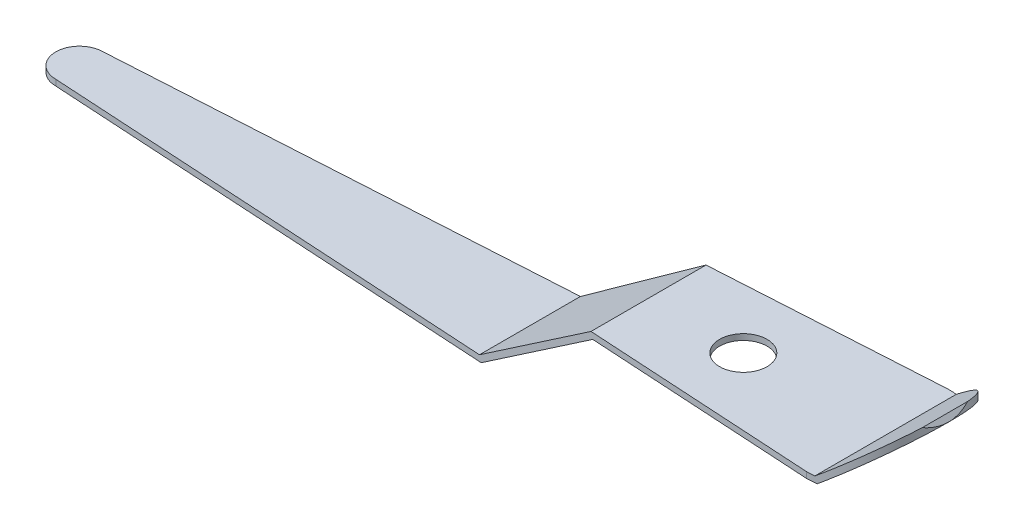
ISO-10303-21;
HEADER;
FILE_DESCRIPTION(('STEP AP214'),'2;1');
FILE_NAME('part.step','',(''),(''),'','','');
FILE_SCHEMA(('AUTOMOTIVE_DESIGN { 1 0 10303 214 1 1 1 1 }'));
ENDSEC;
DATA;
#1=APPLICATION_CONTEXT('core data for automotive mechanical design processes');
#2=APPLICATION_PROTOCOL_DEFINITION('international standard','automotive_design',2000,#1);
#3=PRODUCT_CONTEXT('',#1,'mechanical');
#4=PRODUCT('Part','Part','',(#3));
#5=PRODUCT_RELATED_PRODUCT_CATEGORY('part','',(#4));
#6=PRODUCT_DEFINITION_FORMATION('','',#4);
#7=PRODUCT_DEFINITION_CONTEXT('part definition',#1,'design');
#8=PRODUCT_DEFINITION('design','',#6,#7);
#9=PRODUCT_DEFINITION_SHAPE('','',#8);
#10=(LENGTH_UNIT() NAMED_UNIT(*) SI_UNIT(.MILLI.,.METRE.));
#11=(NAMED_UNIT(*) PLANE_ANGLE_UNIT() SI_UNIT($,.RADIAN.));
#12=(NAMED_UNIT(*) SI_UNIT($,.STERADIAN.) SOLID_ANGLE_UNIT());
#13=UNCERTAINTY_MEASURE_WITH_UNIT(LENGTH_MEASURE(1.E-05),#10,'distance_accuracy_value','');
#14=(GEOMETRIC_REPRESENTATION_CONTEXT(3) GLOBAL_UNCERTAINTY_ASSIGNED_CONTEXT((#13)) GLOBAL_UNIT_ASSIGNED_CONTEXT((#10,
#11,#12)) REPRESENTATION_CONTEXT('',''));
#15=CARTESIAN_POINT('',(0.,0.,0.));
#16=DIRECTION('',(0.,0.,1.));
#17=DIRECTION('',(1.,0.,0.));
#18=AXIS2_PLACEMENT_3D('',#15,#16,#17);
#19=CARTESIAN_POINT('',(0.,0.,12.));
#20=DIRECTION('',(0.,-1.,0.));
#21=DIRECTION('',(0.,0.,-1.));
#22=AXIS2_PLACEMENT_3D('',#19,#20,#21);
#23=PLANE('',#22);
#24=DIRECTION('',(0.998239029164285,0.,-0.0593198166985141));
#25=VECTOR('',#24,1.);
#26=CARTESIAN_POINT('',(-0.466685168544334,0.,4.14658143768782));
#27=LINE('',#26,#25);
#28=CARTESIAN_POINT('',(2.,0.,4.));
#29=VERTEX_POINT('',#28);
#30=CARTESIAN_POINT('',(40.,0.,1.74187046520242));
#31=VERTEX_POINT('',#30);
#32=EDGE_CURVE('E136',#29,#31,#27,.T.);
#33=ORIENTED_EDGE('',*,*,#32,.F.);
#34=CARTESIAN_POINT('',(2.,0.,6.));
#35=DIRECTION('',(0.,-1.,0.));
#36=DIRECTION('',(0.,0.,-1.));
#37=AXIS2_PLACEMENT_3D('',#34,#35,#36);
#38=CIRCLE('',#37,2.);
#39=CARTESIAN_POINT('',(2.,0.,8.));
#40=VERTEX_POINT('',#39);
#41=EDGE_CURVE('E12',#40,#29,#38,.T.);
#42=ORIENTED_EDGE('',*,*,#41,.F.);
#43=DIRECTION('',(-0.998239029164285,0.,-0.0593198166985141));
#44=VECTOR('',#43,1.);
#45=CARTESIAN_POINT('',(0.243899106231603,0.,7.89564465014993));
#46=LINE('',#45,#44);
#47=CARTESIAN_POINT('',(40.,0.,10.2581295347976));
#48=VERTEX_POINT('',#47);
#49=EDGE_CURVE('E154',#48,#40,#46,.T.);
#50=ORIENTED_EDGE('',*,*,#49,.F.);
#51=DIRECTION('',(0.,0.,-1.));
#52=VECTOR('',#51,1.);
#53=CARTESIAN_POINT('',(40.,0.,12.));
#54=LINE('',#53,#52);
#55=EDGE_CURVE('E164',#48,#31,#54,.T.);
#56=ORIENTED_EDGE('',*,*,#55,.T.);
#57=EDGE_LOOP('',(#33,#42,#50,#56));
#58=FACE_BOUND('',#57,.T.);
#59=ADVANCED_FACE('F28',(#58),#23,.F.);
#60=CARTESIAN_POINT('',(40.,0.,12.));
#61=DIRECTION('',(0.573462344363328,-0.81923192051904,0.));
#62=DIRECTION('',(0.819231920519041,0.573462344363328,0.));
#63=AXIS2_PLACEMENT_3D('',#60,#61,#62);
#64=PLANE('',#63);
#65=DIRECTION('',(0.818262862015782,0.572784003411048,-0.0486248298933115));
#66=VECTOR('',#65,1.);
#67=CARTESIAN_POINT('',(39.5918506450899,-0.28570454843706,1.76612452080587));
#68=LINE('',#67,#66);
#69=CARTESIAN_POINT('',(50.,7.,1.147625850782));
#70=VERTEX_POINT('',#69);
#71=EDGE_CURVE('E139',#31,#70,#68,.T.);
#72=ORIENTED_EDGE('',*,*,#71,.F.);
#73=ORIENTED_EDGE('',*,*,#55,.F.);
#74=DIRECTION('',(-0.818262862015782,-0.572784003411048,-0.0486248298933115));
#75=VECTOR('',#74,1.);
#76=CARTESIAN_POINT('',(40.0693053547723,0.048513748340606,10.26224796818));
#77=LINE('',#76,#75);
#78=CARTESIAN_POINT('',(50.,7.,10.852374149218));
#79=VERTEX_POINT('',#78);
#80=EDGE_CURVE('E156',#79,#48,#77,.T.);
#81=ORIENTED_EDGE('',*,*,#80,.F.);
#82=DIRECTION('',(0.,0.,-1.));
#83=VECTOR('',#82,1.);
#84=CARTESIAN_POINT('',(50.,7.,12.));
#85=LINE('',#84,#83);
#86=EDGE_CURVE('E167',#79,#70,#85,.T.);
#87=ORIENTED_EDGE('',*,*,#86,.T.);
#88=EDGE_LOOP('',(#72,#73,#81,#87));
#89=FACE_BOUND('',#88,.T.);
#90=ADVANCED_FACE('F238',(#89),#64,.F.);
#91=CARTESIAN_POINT('',(50.,7.,12.));
#92=DIRECTION('',(0.,-1.,0.));
#93=DIRECTION('',(0.,0.,-1.));
#94=AXIS2_PLACEMENT_3D('',#91,#92,#93);
#95=PLANE('',#94);
#96=CARTESIAN_POINT('',(58.,7.,6.));
#97=DIRECTION('',(0.,1.,0.));
#98=DIRECTION('',(0.,0.,1.));
#99=AXIS2_PLACEMENT_3D('',#96,#97,#98);
#100=CIRCLE('',#99,2.);
#101=CARTESIAN_POINT('',(58.,7.,8.));
#102=VERTEX_POINT('',#101);
#103=EDGE_CURVE('E206',#102,#102,#100,.T.);
#104=ORIENTED_EDGE('',*,*,#103,.F.);
#105=EDGE_LOOP('',(#104));
#106=FACE_BOUND('',#105,.T.);
#107=DIRECTION('',(0.998239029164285,0.,-0.0593198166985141));
#108=VECTOR('',#107,1.);
#109=CARTESIAN_POINT('',(49.3573727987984,7.,1.18581362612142));
#110=LINE('',#109,#108);
#111=CARTESIAN_POINT('',(69.3123475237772,7.,0.));
#112=VERTEX_POINT('',#111);
#113=EDGE_CURVE('E146',#70,#112,#110,.T.);
#114=ORIENTED_EDGE('',*,*,#113,.F.);
#115=ORIENTED_EDGE('',*,*,#86,.F.);
#116=DIRECTION('',(-0.998239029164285,0.,-0.0593198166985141));
#117=VECTOR('',#116,1.);
#118=CARTESIAN_POINT('',(50.0679570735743,7.,10.8564124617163));
#119=LINE('',#118,#117);
#120=CARTESIAN_POINT('',(69.3123475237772,7.,12.));
#121=VERTEX_POINT('',#120);
#122=EDGE_CURVE('E122',#121,#79,#119,.T.);
#123=ORIENTED_EDGE('',*,*,#122,.F.);
#124=CARTESIAN_POINT('',(69.3123475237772,7.,6.));
#125=DIRECTION('',(0.,-1.,0.));
#126=DIRECTION('',(0.,0.,-1.));
#127=AXIS2_PLACEMENT_3D('',#124,#125,#126);
#128=CIRCLE('',#127,6.);
#129=CARTESIAN_POINT('',(70.,7.,11.9604642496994));
#130=VERTEX_POINT('',#129);
#131=EDGE_CURVE('E126',#130,#121,#128,.T.);
#132=ORIENTED_EDGE('',*,*,#131,.F.);
#133=DIRECTION('',(0.,0.,-1.));
#134=VECTOR('',#133,1.);
#135=CARTESIAN_POINT('',(70.,7.,12.));
#136=LINE('',#135,#134);
#137=CARTESIAN_POINT('',(70.,7.,0.0395357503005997));
#138=VERTEX_POINT('',#137);
#139=EDGE_CURVE('E170',#130,#138,#136,.T.);
#140=ORIENTED_EDGE('',*,*,#139,.T.);
#141=EDGE_CURVE('E202',#112,#138,#128,.T.);
#142=ORIENTED_EDGE('',*,*,#141,.F.);
#143=EDGE_LOOP('',(#114,#115,#123,#132,#140,#142));
#144=FACE_BOUND('',#143,.T.);
#145=ADVANCED_FACE('F244',(#106,#144),#95,.F.);
#146=CARTESIAN_POINT('',(70.,7.,12.));
#147=DIRECTION('',(0.624695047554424,-0.780868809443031,0.));
#148=DIRECTION('',(0.780868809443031,0.624695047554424,0.));
#149=AXIS2_PLACEMENT_3D('',#146,#147,#148);
#150=PLANE('',#149);
#151=CARTESIAN_POINT('',(69.3123475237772,6.44987801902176,6.));
#152=DIRECTION('',(0.624695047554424,-0.780868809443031,0.));
#153=DIRECTION('',(0.780868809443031,0.624695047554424,0.));
#154=AXIS2_PLACEMENT_3D('',#151,#152,#153);
#155=ELLIPSE('',#154,7.68374908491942,6.);
#156=CARTESIAN_POINT('',(75.,11.,7.91065677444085));
#157=VERTEX_POINT('',#156);
#158=EDGE_CURVE('E200',#157,#130,#155,.T.);
#159=ORIENTED_EDGE('',*,*,#158,.F.);
#160=DIRECTION('',(0.,0.,-1.));
#161=VECTOR('',#160,1.);
#162=CARTESIAN_POINT('',(75.,11.,12.));
#163=LINE('',#162,#161);
#164=CARTESIAN_POINT('',(75.,11.,4.08934322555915));
#165=VERTEX_POINT('',#164);
#166=EDGE_CURVE('E173',#157,#165,#163,.T.);
#167=ORIENTED_EDGE('',*,*,#166,.T.);
#168=EDGE_CURVE('E210',#138,#165,#155,.T.);
#169=ORIENTED_EDGE('',*,*,#168,.F.);
#170=ORIENTED_EDGE('',*,*,#139,.F.);
#171=EDGE_LOOP('',(#159,#167,#169,#170));
#172=FACE_BOUND('',#171,.T.);
#173=ADVANCED_FACE('F251',(#172),#150,.F.);
#174=CARTESIAN_POINT('',(75.,11.,12.));
#175=DIRECTION('',(-0.780868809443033,-0.624695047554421,0.));
#176=DIRECTION('',(0.624695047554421,-0.780868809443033,0.));
#177=AXIS2_PLACEMENT_3D('',#174,#175,#176);
#178=PLANE('',#177);
#179=CARTESIAN_POINT('',(69.3123475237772,18.1095655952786,6.));
#180=DIRECTION('',(-0.780868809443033,-0.624695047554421,0.));
#181=DIRECTION('',(-0.624695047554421,0.780868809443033,0.));
#182=AXIS2_PLACEMENT_3D('',#179,#180,#181);
#183=ELLIPSE('',#182,9.60468635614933,6.);
#184=CARTESIAN_POINT('',(75.3123475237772,10.6095655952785,6.));
#185=VERTEX_POINT('',#184);
#186=EDGE_CURVE('E211',#165,#185,#183,.T.);
#187=ORIENTED_EDGE('',*,*,#186,.F.);
#188=ORIENTED_EDGE('',*,*,#166,.F.);
#189=EDGE_CURVE('E209',#185,#157,#183,.T.);
#190=ORIENTED_EDGE('',*,*,#189,.F.);
#191=EDGE_LOOP('',(#187,#188,#190));
#192=FACE_BOUND('',#191,.T.);
#193=ADVANCED_FACE('F254',(#192),#178,.F.);
#194=CARTESIAN_POINT('',(2.,-12.,6.));
#195=DIRECTION('',(0.,1.,0.));
#196=DIRECTION('',(0.,0.,1.));
#197=AXIS2_PLACEMENT_3D('',#194,#195,#196);
#198=CYLINDRICAL_SURFACE('',#197,2.);
#199=CARTESIAN_POINT('',(2.,-0.5,6.));
#200=DIRECTION('',(0.,1.,0.));
#201=DIRECTION('',(0.,0.,1.));
#202=AXIS2_PLACEMENT_3D('',#199,#200,#201);
#203=CIRCLE('',#202,2.);
#204=CARTESIAN_POINT('',(2.,-0.5,4.));
#205=VERTEX_POINT('',#204);
#206=CARTESIAN_POINT('',(2.,-0.5,8.));
#207=VERTEX_POINT('',#206);
#208=EDGE_CURVE('E162',#205,#207,#203,.T.);
#209=ORIENTED_EDGE('',*,*,#208,.T.);
#210=DIRECTION('',(0.,1.,0.));
#211=VECTOR('',#210,1.);
#212=CARTESIAN_POINT('',(2.,-12.,8.));
#213=LINE('',#212,#211);
#214=EDGE_CURVE('E128',#207,#40,#213,.T.);
#215=ORIENTED_EDGE('',*,*,#214,.T.);
#216=ORIENTED_EDGE('',*,*,#41,.T.);
#217=DIRECTION('',(0.,1.,0.));
#218=VECTOR('',#217,1.);
#219=CARTESIAN_POINT('',(2.,-12.,4.));
#220=LINE('',#219,#218);
#221=EDGE_CURVE('E192',#205,#29,#220,.T.);
#222=ORIENTED_EDGE('',*,*,#221,.F.);
#223=EDGE_LOOP('',(#209,#215,#216,#222));
#224=FACE_BOUND('',#223,.T.);
#225=ADVANCED_FACE('F195',(#224),#198,.T.);
#226=CARTESIAN_POINT('',(69.3123475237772,-12.,12.));
#227=DIRECTION('',(-0.0593198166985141,0.,0.998239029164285));
#228=DIRECTION('',(0.998239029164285,0.,0.0593198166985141));
#229=AXIS2_PLACEMENT_3D('',#226,#227,#228);
#230=PLANE('',#229);
#231=DIRECTION('',(0.998239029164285,0.,0.0593198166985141));
#232=VECTOR('',#231,1.);
#233=CARTESIAN_POINT('',(0.243899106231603,-0.5,7.89564465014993));
#234=LINE('',#233,#232);
#235=CARTESIAN_POINT('',(40.1576111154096,-0.5,10.2674954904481));
#236=VERTEX_POINT('',#235);
#237=EDGE_CURVE('E160',#207,#236,#234,.T.);
#238=ORIENTED_EDGE('',*,*,#237,.T.);
#239=DIRECTION('',(0.818262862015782,0.572784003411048,0.0486248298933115));
#240=VECTOR('',#239,1.);
#241=CARTESIAN_POINT('',(40.2265438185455,-0.451747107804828,10.2715917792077));
#242=LINE('',#241,#240);
#243=CARTESIAN_POINT('',(50.1576111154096,6.5,10.8617401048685));
#244=VERTEX_POINT('',#243);
#245=EDGE_CURVE('E118',#236,#244,#242,.T.);
#246=ORIENTED_EDGE('',*,*,#245,.T.);
#247=DIRECTION('',(0.998239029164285,0.,0.0593198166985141));
#248=VECTOR('',#247,1.);
#249=CARTESIAN_POINT('',(50.2250135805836,6.5,10.8657454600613));
#250=LINE('',#249,#248);
#251=CARTESIAN_POINT('',(69.3123475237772,6.5,12.));
#252=VERTEX_POINT('',#251);
#253=EDGE_CURVE('E113',#244,#252,#250,.T.);
#254=ORIENTED_EDGE('',*,*,#253,.T.);
#255=DIRECTION('',(0.,1.,0.));
#256=VECTOR('',#255,1.);
#257=CARTESIAN_POINT('',(69.3123475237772,-12.,12.));
#258=LINE('',#257,#256);
#259=EDGE_CURVE('E115',#252,#121,#258,.T.);
#260=ORIENTED_EDGE('',*,*,#259,.T.);
#261=ORIENTED_EDGE('',*,*,#122,.T.);
#262=ORIENTED_EDGE('',*,*,#80,.T.);
#263=ORIENTED_EDGE('',*,*,#49,.T.);
#264=ORIENTED_EDGE('',*,*,#214,.F.);
#265=EDGE_LOOP('',(#238,#246,#254,#260,#261,#262,#263,#264));
#266=FACE_BOUND('',#265,.T.);
#267=ADVANCED_FACE('F114',(#266),#230,.T.);
#268=CARTESIAN_POINT('',(2.,-12.,4.));
#269=DIRECTION('',(-0.0593198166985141,0.,-0.998239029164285));
#270=DIRECTION('',(-0.998239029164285,0.,0.0593198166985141));
#271=AXIS2_PLACEMENT_3D('',#268,#269,#270);
#272=PLANE('',#271);
#273=DIRECTION('',(-0.998239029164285,0.,0.0593198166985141));
#274=VECTOR('',#273,1.);
#275=CARTESIAN_POINT('',(-0.466685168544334,-0.5,4.14658143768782));
#276=LINE('',#275,#274);
#277=CARTESIAN_POINT('',(40.1576111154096,-0.500000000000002,1.73250450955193));
#278=VERTEX_POINT('',#277);
#279=EDGE_CURVE('E152',#278,#205,#276,.T.);
#280=ORIENTED_EDGE('',*,*,#279,.T.);
#281=ORIENTED_EDGE('',*,*,#221,.T.);
#282=ORIENTED_EDGE('',*,*,#32,.T.);
#283=ORIENTED_EDGE('',*,*,#71,.T.);
#284=ORIENTED_EDGE('',*,*,#113,.T.);
#285=DIRECTION('',(0.,1.,0.));
#286=VECTOR('',#285,1.);
#287=CARTESIAN_POINT('',(69.3123475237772,-12.,0.));
#288=LINE('',#287,#286);
#289=CARTESIAN_POINT('',(69.3123475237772,6.5,0.));
#290=VERTEX_POINT('',#289);
#291=EDGE_CURVE('E127',#290,#112,#288,.T.);
#292=ORIENTED_EDGE('',*,*,#291,.F.);
#293=DIRECTION('',(-0.998239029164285,0.,0.0593198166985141));
#294=VECTOR('',#293,1.);
#295=CARTESIAN_POINT('',(49.5144293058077,6.5,1.17648062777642));
#296=LINE('',#295,#294);
#297=CARTESIAN_POINT('',(50.1576111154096,6.5,1.13825989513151));
#298=VERTEX_POINT('',#297);
#299=EDGE_CURVE('E148',#290,#298,#296,.T.);
#300=ORIENTED_EDGE('',*,*,#299,.T.);
#301=DIRECTION('',(-0.818262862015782,-0.572784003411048,0.0486248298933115));
#302=VECTOR('',#301,1.);
#303=CARTESIAN_POINT('',(39.7490891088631,-0.785965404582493,1.75678070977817));
#304=LINE('',#303,#302);
#305=EDGE_CURVE('E150',#298,#278,#304,.T.);
#306=ORIENTED_EDGE('',*,*,#305,.T.);
#307=EDGE_LOOP('',(#280,#281,#282,#283,#284,#292,#300,#306));
#308=FACE_BOUND('',#307,.T.);
#309=ADVANCED_FACE('F191',(#308),#272,.T.);
#310=CARTESIAN_POINT('',(69.3123475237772,-12.,6.));
#311=DIRECTION('',(0.,1.,0.));
#312=DIRECTION('',(0.,0.,1.));
#313=AXIS2_PLACEMENT_3D('',#310,#311,#312);
#314=CYLINDRICAL_SURFACE('',#313,6.);
#315=CARTESIAN_POINT('',(69.3123475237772,6.5,6.));
#316=DIRECTION('',(0.,1.,0.));
#317=DIRECTION('',(0.,0.,1.));
#318=AXIS2_PLACEMENT_3D('',#315,#316,#317);
#319=CIRCLE('',#318,6.);
#320=CARTESIAN_POINT('',(70.1753905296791,6.5,11.9376053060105));
#321=VERTEX_POINT('',#320);
#322=EDGE_CURVE('E49',#252,#321,#319,.T.);
#323=ORIENTED_EDGE('',*,*,#322,.T.);
#324=CARTESIAN_POINT('',(69.3123475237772,5.8095655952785,6.));
#325=DIRECTION('',(-0.624695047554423,0.780868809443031,0.));
#326=DIRECTION('',(0.780868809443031,0.624695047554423,0.));
#327=AXIS2_PLACEMENT_3D('',#324,#325,#326);
#328=ELLIPSE('',#327,7.68374908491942,6.);
#329=EDGE_CURVE('E44',#321,#185,#328,.T.);
#330=ORIENTED_EDGE('',*,*,#329,.T.);
#331=ORIENTED_EDGE('',*,*,#189,.T.);
#332=ORIENTED_EDGE('',*,*,#158,.T.);
#333=ORIENTED_EDGE('',*,*,#131,.T.);
#334=ORIENTED_EDGE('',*,*,#259,.F.);
#335=EDGE_LOOP('',(#323,#330,#331,#332,#333,#334));
#336=FACE_BOUND('',#335,.T.);
#337=ADVANCED_FACE('F124',(#336),#314,.T.);
#338=CARTESIAN_POINT('',(70.1753905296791,6.5,0.0623946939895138));
#339=VERTEX_POINT('',#338);
#340=EDGE_CURVE('E137',#339,#290,#319,.T.);
#341=ORIENTED_EDGE('',*,*,#340,.T.);
#342=ORIENTED_EDGE('',*,*,#291,.T.);
#343=ORIENTED_EDGE('',*,*,#141,.T.);
#344=ORIENTED_EDGE('',*,*,#168,.T.);
#345=ORIENTED_EDGE('',*,*,#186,.T.);
#346=EDGE_CURVE('E141',#185,#339,#328,.T.);
#347=ORIENTED_EDGE('',*,*,#346,.T.);
#348=EDGE_LOOP('',(#341,#342,#343,#344,#345,#347));
#349=FACE_BOUND('',#348,.T.);
#350=ADVANCED_FACE('F219',(#349),#314,.T.);
#351=CARTESIAN_POINT('',(0.,-0.5,12.));
#352=DIRECTION('',(0.,1.,0.));
#353=DIRECTION('',(0.,0.,1.));
#354=AXIS2_PLACEMENT_3D('',#351,#352,#353);
#355=PLANE('',#354);
#356=ORIENTED_EDGE('',*,*,#279,.F.);
#357=DIRECTION('',(0.,0.,-1.));
#358=VECTOR('',#357,1.);
#359=CARTESIAN_POINT('',(40.1576111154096,-0.5,12.));
#360=LINE('',#359,#358);
#361=EDGE_CURVE('E37',#236,#278,#360,.T.);
#362=ORIENTED_EDGE('',*,*,#361,.F.);
#363=ORIENTED_EDGE('',*,*,#237,.F.);
#364=ORIENTED_EDGE('',*,*,#208,.F.);
#365=EDGE_LOOP('',(#356,#362,#363,#364));
#366=FACE_BOUND('',#365,.T.);
#367=ADVANCED_FACE('F30',(#366),#355,.F.);
#368=CARTESIAN_POINT('',(40.1576111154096,-0.5,12.));
#369=DIRECTION('',(-0.573462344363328,0.81923192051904,0.));
#370=DIRECTION('',(-0.819231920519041,-0.573462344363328,0.));
#371=AXIS2_PLACEMENT_3D('',#368,#369,#370);
#372=PLANE('',#371);
#373=ORIENTED_EDGE('',*,*,#305,.F.);
#374=DIRECTION('',(0.,0.,-1.));
#375=VECTOR('',#374,1.);
#376=CARTESIAN_POINT('',(50.1576111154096,6.5,12.));
#377=LINE('',#376,#375);
#378=EDGE_CURVE('E177',#244,#298,#377,.T.);
#379=ORIENTED_EDGE('',*,*,#378,.F.);
#380=ORIENTED_EDGE('',*,*,#245,.F.);
#381=ORIENTED_EDGE('',*,*,#361,.T.);
#382=EDGE_LOOP('',(#373,#379,#380,#381));
#383=FACE_BOUND('',#382,.T.);
#384=ADVANCED_FACE('F183',(#383),#372,.F.);
#385=CARTESIAN_POINT('',(50.1576111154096,6.5,12.));
#386=DIRECTION('',(0.,1.,0.));
#387=DIRECTION('',(0.,0.,1.));
#388=AXIS2_PLACEMENT_3D('',#385,#386,#387);
#389=PLANE('',#388);
#390=CARTESIAN_POINT('',(58.,6.5,6.));
#391=DIRECTION('',(0.,1.,0.));
#392=DIRECTION('',(0.,0.,1.));
#393=AXIS2_PLACEMENT_3D('',#390,#391,#392);
#394=CIRCLE('',#393,2.);
#395=CARTESIAN_POINT('',(58.,6.5,8.));
#396=VERTEX_POINT('',#395);
#397=EDGE_CURVE('E32',#396,#396,#394,.T.);
#398=ORIENTED_EDGE('',*,*,#397,.T.);
#399=EDGE_LOOP('',(#398));
#400=FACE_BOUND('',#399,.T.);
#401=ORIENTED_EDGE('',*,*,#299,.F.);
#402=ORIENTED_EDGE('',*,*,#340,.F.);
#403=DIRECTION('',(0.,0.,-1.));
#404=VECTOR('',#403,1.);
#405=CARTESIAN_POINT('',(70.1753905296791,6.5,12.));
#406=LINE('',#405,#404);
#407=EDGE_CURVE('E135',#321,#339,#406,.T.);
#408=ORIENTED_EDGE('',*,*,#407,.F.);
#409=ORIENTED_EDGE('',*,*,#322,.F.);
#410=ORIENTED_EDGE('',*,*,#253,.F.);
#411=ORIENTED_EDGE('',*,*,#378,.T.);
#412=EDGE_LOOP('',(#401,#402,#408,#409,#410,#411));
#413=FACE_BOUND('',#412,.T.);
#414=ADVANCED_FACE('F132',(#400,#413),#389,.F.);
#415=CARTESIAN_POINT('',(70.1753905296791,6.5,12.));
#416=DIRECTION('',(-0.624695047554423,0.780868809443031,0.));
#417=DIRECTION('',(-0.780868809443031,-0.624695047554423,0.));
#418=AXIS2_PLACEMENT_3D('',#415,#416,#417);
#419=PLANE('',#418);
#420=ORIENTED_EDGE('',*,*,#346,.F.);
#421=ORIENTED_EDGE('',*,*,#329,.F.);
#422=ORIENTED_EDGE('',*,*,#407,.T.);
#423=EDGE_LOOP('',(#420,#421,#422));
#424=FACE_BOUND('',#423,.T.);
#425=ADVANCED_FACE('F222',(#424),#419,.F.);
#426=CARTESIAN_POINT('',(58.,-0.500000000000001,6.));
#427=DIRECTION('',(0.,1.,0.));
#428=DIRECTION('',(0.,0.,1.));
#429=AXIS2_PLACEMENT_3D('',#426,#427,#428);
#430=CYLINDRICAL_SURFACE('',#429,2.);
#431=ORIENTED_EDGE('',*,*,#103,.T.);
#432=EDGE_LOOP('',(#431));
#433=FACE_BOUND('',#432,.T.);
#434=ORIENTED_EDGE('',*,*,#397,.F.);
#435=EDGE_LOOP('',(#434));
#436=FACE_BOUND('',#435,.T.);
#437=ADVANCED_FACE('F224',(#433,#436),#430,.F.);
#438=CLOSED_SHELL('',(#59,#90,#145,#173,#193,#225,#267,#309,#337,#350,#367,#384,#414,#425,#437));
#439=MANIFOLD_SOLID_BREP('B2',#438);
#440=ADVANCED_BREP_SHAPE_REPRESENTATION('',(#18,#439),#14);
#441=SHAPE_DEFINITION_REPRESENTATION(#9,#440);
ENDSEC;
END-ISO-10303-21;
